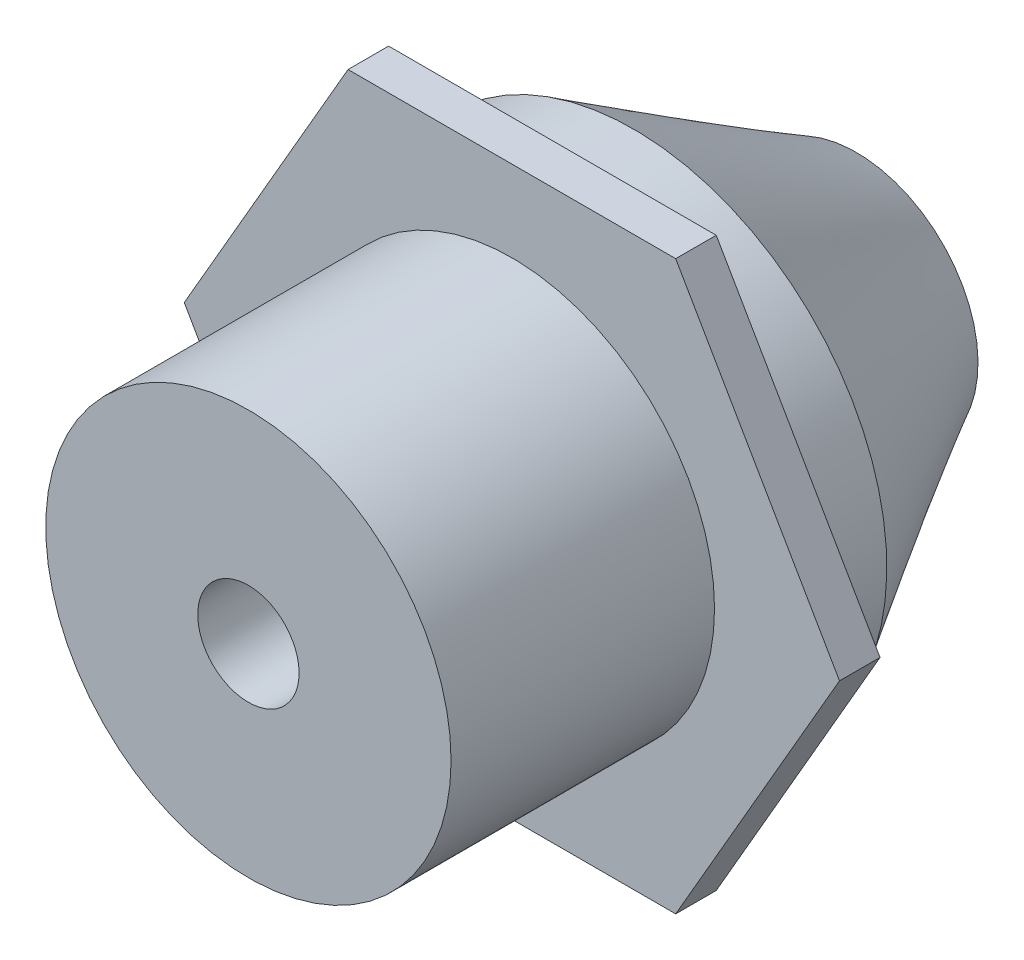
ISO-10303-21;
HEADER;
FILE_DESCRIPTION(('STEP AP214'),'2;1');
FILE_NAME('part.step','',(''),(''),'','','');
FILE_SCHEMA(('AUTOMOTIVE_DESIGN { 1 0 10303 214 1 1 1 1 }'));
ENDSEC;
DATA;
#1=APPLICATION_CONTEXT('core data for automotive mechanical design processes');
#2=APPLICATION_PROTOCOL_DEFINITION('international standard','automotive_design',2000,#1);
#3=PRODUCT_CONTEXT('',#1,'mechanical');
#4=PRODUCT('Part','Part','',(#3));
#5=PRODUCT_RELATED_PRODUCT_CATEGORY('part','',(#4));
#6=PRODUCT_DEFINITION_FORMATION('','',#4);
#7=PRODUCT_DEFINITION_CONTEXT('part definition',#1,'design');
#8=PRODUCT_DEFINITION('design','',#6,#7);
#9=PRODUCT_DEFINITION_SHAPE('','',#8);
#10=(LENGTH_UNIT() NAMED_UNIT(*) SI_UNIT(.MILLI.,.METRE.));
#11=(NAMED_UNIT(*) PLANE_ANGLE_UNIT() SI_UNIT($,.RADIAN.));
#12=(NAMED_UNIT(*) SI_UNIT($,.STERADIAN.) SOLID_ANGLE_UNIT());
#13=UNCERTAINTY_MEASURE_WITH_UNIT(LENGTH_MEASURE(1.E-05),#10,'distance_accuracy_value','');
#14=(GEOMETRIC_REPRESENTATION_CONTEXT(3) GLOBAL_UNCERTAINTY_ASSIGNED_CONTEXT((#13)) GLOBAL_UNIT_ASSIGNED_CONTEXT((#10,
#11,#12)) REPRESENTATION_CONTEXT('',''));
#15=CARTESIAN_POINT('',(0.,0.,0.));
#16=DIRECTION('',(0.,0.,1.));
#17=DIRECTION('',(1.,0.,0.));
#18=AXIS2_PLACEMENT_3D('',#15,#16,#17);
#19=CARTESIAN_POINT('',(0.,0.,-130.));
#20=DIRECTION('',(0.,0.,1.));
#21=DIRECTION('',(1.,0.,0.));
#22=AXIS2_PLACEMENT_3D('',#19,#20,#21);
#23=CYLINDRICAL_SURFACE('',#22,100.);
#24=CARTESIAN_POINT('',(0.,0.,-130.));
#25=DIRECTION('',(0.,0.,1.));
#26=DIRECTION('',(1.,0.,0.));
#27=AXIS2_PLACEMENT_3D('',#24,#25,#26);
#28=CIRCLE('',#27,100.);
#29=CARTESIAN_POINT('',(100.,0.,-130.));
#30=VERTEX_POINT('',#29);
#31=EDGE_CURVE('E150',#30,#30,#28,.T.);
#32=ORIENTED_EDGE('',*,*,#31,.T.);
#33=EDGE_LOOP('',(#32));
#34=FACE_BOUND('',#33,.T.);
#35=CARTESIAN_POINT('',(0.,0.,0.));
#36=DIRECTION('',(0.,0.,1.));
#37=DIRECTION('',(1.,0.,0.));
#38=AXIS2_PLACEMENT_3D('',#35,#36,#37);
#39=CIRCLE('',#38,100.);
#40=CARTESIAN_POINT('',(100.,0.,0.));
#41=VERTEX_POINT('',#40);
#42=EDGE_CURVE('E52',#41,#41,#39,.T.);
#43=ORIENTED_EDGE('',*,*,#42,.F.);
#44=EDGE_LOOP('',(#43));
#45=FACE_BOUND('',#44,.T.);
#46=ADVANCED_FACE('F43',(#34,#45),#23,.T.);
#47=CARTESIAN_POINT('',(0.,0.,0.));
#48=DIRECTION('',(0.,0.,1.));
#49=DIRECTION('',(1.,0.,0.));
#50=AXIS2_PLACEMENT_3D('',#47,#48,#49);
#51=PLANE('',#50);
#52=CARTESIAN_POINT('',(0.,0.,0.));
#53=DIRECTION('',(0.,0.,1.));
#54=DIRECTION('',(1.,0.,0.));
#55=AXIS2_PLACEMENT_3D('',#52,#53,#54);
#56=CIRCLE('',#55,25.);
#57=CARTESIAN_POINT('',(25.,0.,0.));
#58=VERTEX_POINT('',#57);
#59=EDGE_CURVE('E165',#58,#58,#56,.T.);
#60=ORIENTED_EDGE('',*,*,#59,.F.);
#61=EDGE_LOOP('',(#60));
#62=FACE_BOUND('',#61,.T.);
#63=ORIENTED_EDGE('',*,*,#42,.T.);
#64=EDGE_LOOP('',(#63));
#65=FACE_BOUND('',#64,.T.);
#66=ADVANCED_FACE('F200',(#62,#65),#51,.T.);
#67=CARTESIAN_POINT('',(-161.658075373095,0.,-150.));
#68=DIRECTION('',(0.866025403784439,-0.5,0.));
#69=DIRECTION('',(0.5,0.866025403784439,0.));
#70=AXIS2_PLACEMENT_3D('',#67,#68,#69);
#71=PLANE('',#70);
#72=DIRECTION('',(0.5,0.866025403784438,0.));
#73=VECTOR('',#72,1.);
#74=CARTESIAN_POINT('',(-161.658075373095,0.,-130.));
#75=LINE('',#74,#73);
#76=CARTESIAN_POINT('',(-161.658075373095,0.,-130.));
#77=VERTEX_POINT('',#76);
#78=CARTESIAN_POINT('',(-80.8290376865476,140.,-130.));
#79=VERTEX_POINT('',#78);
#80=EDGE_CURVE('E130',#77,#79,#75,.T.);
#81=ORIENTED_EDGE('',*,*,#80,.T.);
#82=DIRECTION('',(0.,0.,1.));
#83=VECTOR('',#82,1.);
#84=CARTESIAN_POINT('',(-80.8290376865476,140.,-150.));
#85=LINE('',#84,#83);
#86=CARTESIAN_POINT('',(-80.8290376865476,140.,-150.));
#87=VERTEX_POINT('',#86);
#88=EDGE_CURVE('E148',#87,#79,#85,.T.);
#89=ORIENTED_EDGE('',*,*,#88,.F.);
#90=DIRECTION('',(0.5,0.866025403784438,0.));
#91=VECTOR('',#90,1.);
#92=CARTESIAN_POINT('',(-161.658075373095,0.,-150.));
#93=LINE('',#92,#91);
#94=CARTESIAN_POINT('',(-161.658075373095,0.,-150.));
#95=VERTEX_POINT('',#94);
#96=EDGE_CURVE('E141',#95,#87,#93,.T.);
#97=ORIENTED_EDGE('',*,*,#96,.F.);
#98=DIRECTION('',(0.,0.,1.));
#99=VECTOR('',#98,1.);
#100=CARTESIAN_POINT('',(-161.658075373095,0.,-150.));
#101=LINE('',#100,#99);
#102=EDGE_CURVE('E126',#95,#77,#101,.T.);
#103=ORIENTED_EDGE('',*,*,#102,.T.);
#104=EDGE_LOOP('',(#81,#89,#97,#103));
#105=FACE_BOUND('',#104,.T.);
#106=ADVANCED_FACE('F186',(#105),#71,.F.);
#107=CARTESIAN_POINT('',(-80.8290376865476,140.,-150.));
#108=DIRECTION('',(0.,-1.,0.));
#109=DIRECTION('',(1.,0.,0.));
#110=AXIS2_PLACEMENT_3D('',#107,#108,#109);
#111=PLANE('',#110);
#112=DIRECTION('',(1.,0.,0.));
#113=VECTOR('',#112,1.);
#114=CARTESIAN_POINT('',(-80.8290376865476,140.,-130.));
#115=LINE('',#114,#113);
#116=CARTESIAN_POINT('',(80.8290376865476,140.,-130.));
#117=VERTEX_POINT('',#116);
#118=EDGE_CURVE('E133',#79,#117,#115,.T.);
#119=ORIENTED_EDGE('',*,*,#118,.T.);
#120=DIRECTION('',(0.,0.,1.));
#121=VECTOR('',#120,1.);
#122=CARTESIAN_POINT('',(80.8290376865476,140.,-150.));
#123=LINE('',#122,#121);
#124=CARTESIAN_POINT('',(80.8290376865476,140.,-150.));
#125=VERTEX_POINT('',#124);
#126=EDGE_CURVE('E145',#125,#117,#123,.T.);
#127=ORIENTED_EDGE('',*,*,#126,.F.);
#128=DIRECTION('',(1.,0.,0.));
#129=VECTOR('',#128,1.);
#130=CARTESIAN_POINT('',(-80.8290376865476,140.,-150.));
#131=LINE('',#130,#129);
#132=EDGE_CURVE('E99',#87,#125,#131,.T.);
#133=ORIENTED_EDGE('',*,*,#132,.F.);
#134=ORIENTED_EDGE('',*,*,#88,.T.);
#135=EDGE_LOOP('',(#119,#127,#133,#134));
#136=FACE_BOUND('',#135,.T.);
#137=ADVANCED_FACE('F178',(#136),#111,.F.);
#138=CARTESIAN_POINT('',(80.8290376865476,140.,-150.));
#139=DIRECTION('',(-0.866025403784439,-0.5,0.));
#140=DIRECTION('',(0.5,-0.866025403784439,0.));
#141=AXIS2_PLACEMENT_3D('',#138,#139,#140);
#142=PLANE('',#141);
#143=DIRECTION('',(0.499999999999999,-0.866025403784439,0.));
#144=VECTOR('',#143,1.);
#145=CARTESIAN_POINT('',(80.8290376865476,140.,-130.));
#146=LINE('',#145,#144);
#147=CARTESIAN_POINT('',(161.658075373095,-1.11022302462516E-13,-130.));
#148=VERTEX_POINT('',#147);
#149=EDGE_CURVE('E136',#117,#148,#146,.T.);
#150=ORIENTED_EDGE('',*,*,#149,.T.);
#151=DIRECTION('',(0.,0.,1.));
#152=VECTOR('',#151,1.);
#153=CARTESIAN_POINT('',(161.658075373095,-1.11022302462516E-13,-150.));
#154=LINE('',#153,#152);
#155=CARTESIAN_POINT('',(161.658075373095,-1.11022302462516E-13,-150.));
#156=VERTEX_POINT('',#155);
#157=EDGE_CURVE('E121',#156,#148,#154,.T.);
#158=ORIENTED_EDGE('',*,*,#157,.F.);
#159=DIRECTION('',(0.499999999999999,-0.866025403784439,0.));
#160=VECTOR('',#159,1.);
#161=CARTESIAN_POINT('',(80.8290376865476,140.,-150.));
#162=LINE('',#161,#160);
#163=EDGE_CURVE('E112',#125,#156,#162,.T.);
#164=ORIENTED_EDGE('',*,*,#163,.F.);
#165=ORIENTED_EDGE('',*,*,#126,.T.);
#166=EDGE_LOOP('',(#150,#158,#164,#165));
#167=FACE_BOUND('',#166,.T.);
#168=ADVANCED_FACE('F181',(#167),#142,.F.);
#169=CARTESIAN_POINT('',(161.658075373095,-1.11022302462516E-13,-150.));
#170=DIRECTION('',(-0.866025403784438,0.5,0.));
#171=DIRECTION('',(-0.5,-0.866025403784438,0.));
#172=AXIS2_PLACEMENT_3D('',#169,#170,#171);
#173=PLANE('',#172);
#174=DIRECTION('',(-0.5,-0.866025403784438,0.));
#175=VECTOR('',#174,1.);
#176=CARTESIAN_POINT('',(161.658075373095,-1.11022302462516E-13,-130.));
#177=LINE('',#176,#175);
#178=CARTESIAN_POINT('',(80.8290376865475,-140.,-130.));
#179=VERTEX_POINT('',#178);
#180=EDGE_CURVE('E120',#148,#179,#177,.T.);
#181=ORIENTED_EDGE('',*,*,#180,.T.);
#182=DIRECTION('',(0.,0.,1.));
#183=VECTOR('',#182,1.);
#184=CARTESIAN_POINT('',(80.8290376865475,-140.,-150.));
#185=LINE('',#184,#183);
#186=CARTESIAN_POINT('',(80.8290376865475,-140.,-150.));
#187=VERTEX_POINT('',#186);
#188=EDGE_CURVE('E117',#187,#179,#185,.T.);
#189=ORIENTED_EDGE('',*,*,#188,.F.);
#190=DIRECTION('',(-0.5,-0.866025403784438,0.));
#191=VECTOR('',#190,1.);
#192=CARTESIAN_POINT('',(161.658075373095,-1.11022302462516E-13,-150.));
#193=LINE('',#192,#191);
#194=EDGE_CURVE('E106',#156,#187,#193,.T.);
#195=ORIENTED_EDGE('',*,*,#194,.F.);
#196=ORIENTED_EDGE('',*,*,#157,.T.);
#197=EDGE_LOOP('',(#181,#189,#195,#196));
#198=FACE_BOUND('',#197,.T.);
#199=ADVANCED_FACE('F118',(#198),#173,.F.);
#200=CARTESIAN_POINT('',(80.8290376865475,-140.,-150.));
#201=DIRECTION('',(0.,1.,0.));
#202=DIRECTION('',(-1.,0.,0.));
#203=AXIS2_PLACEMENT_3D('',#200,#201,#202);
#204=PLANE('',#203);
#205=DIRECTION('',(-1.,0.,0.));
#206=VECTOR('',#205,1.);
#207=CARTESIAN_POINT('',(80.8290376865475,-140.,-130.));
#208=LINE('',#207,#206);
#209=CARTESIAN_POINT('',(-80.8290376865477,-140.,-130.));
#210=VERTEX_POINT('',#209);
#211=EDGE_CURVE('E84',#179,#210,#208,.T.);
#212=ORIENTED_EDGE('',*,*,#211,.T.);
#213=DIRECTION('',(0.,0.,1.));
#214=VECTOR('',#213,1.);
#215=CARTESIAN_POINT('',(-80.8290376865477,-140.,-150.));
#216=LINE('',#215,#214);
#217=CARTESIAN_POINT('',(-80.8290376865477,-140.,-150.));
#218=VERTEX_POINT('',#217);
#219=EDGE_CURVE('E122',#218,#210,#216,.T.);
#220=ORIENTED_EDGE('',*,*,#219,.F.);
#221=DIRECTION('',(-1.,0.,0.));
#222=VECTOR('',#221,1.);
#223=CARTESIAN_POINT('',(80.8290376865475,-140.,-150.));
#224=LINE('',#223,#222);
#225=EDGE_CURVE('E110',#187,#218,#224,.T.);
#226=ORIENTED_EDGE('',*,*,#225,.F.);
#227=ORIENTED_EDGE('',*,*,#188,.T.);
#228=EDGE_LOOP('',(#212,#220,#226,#227));
#229=FACE_BOUND('',#228,.T.);
#230=ADVANCED_FACE('F124',(#229),#204,.F.);
#231=CARTESIAN_POINT('',(-80.8290376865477,-140.,-150.));
#232=DIRECTION('',(0.866025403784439,0.499999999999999,0.));
#233=DIRECTION('',(-0.499999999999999,0.866025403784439,0.));
#234=AXIS2_PLACEMENT_3D('',#231,#232,#233);
#235=PLANE('',#234);
#236=DIRECTION('',(-0.499999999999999,0.866025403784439,0.));
#237=VECTOR('',#236,1.);
#238=CARTESIAN_POINT('',(-80.8290376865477,-140.,-130.));
#239=LINE('',#238,#237);
#240=EDGE_CURVE('E90',#210,#77,#239,.T.);
#241=ORIENTED_EDGE('',*,*,#240,.T.);
#242=ORIENTED_EDGE('',*,*,#102,.F.);
#243=DIRECTION('',(-0.499999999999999,0.866025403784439,0.));
#244=VECTOR('',#243,1.);
#245=CARTESIAN_POINT('',(-80.8290376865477,-140.,-150.));
#246=LINE('',#245,#244);
#247=EDGE_CURVE('E61',#218,#95,#246,.T.);
#248=ORIENTED_EDGE('',*,*,#247,.F.);
#249=ORIENTED_EDGE('',*,*,#219,.T.);
#250=EDGE_LOOP('',(#241,#242,#248,#249));
#251=FACE_BOUND('',#250,.T.);
#252=ADVANCED_FACE('F187',(#251),#235,.F.);
#253=CARTESIAN_POINT('',(0.,0.,-150.));
#254=DIRECTION('',(0.,0.,-1.));
#255=DIRECTION('',(-1.,0.,0.));
#256=AXIS2_PLACEMENT_3D('',#253,#254,#255);
#257=PLANE('',#256);
#258=CARTESIAN_POINT('',(0.,0.,-150.));
#259=DIRECTION('',(0.,0.,-1.));
#260=DIRECTION('',(-1.,0.,0.));
#261=AXIS2_PLACEMENT_3D('',#258,#259,#260);
#262=CIRCLE('',#261,125.);
#263=CARTESIAN_POINT('',(-125.,0.,-150.));
#264=VERTEX_POINT('',#263);
#265=EDGE_CURVE('E12',#264,#264,#262,.T.);
#266=ORIENTED_EDGE('',*,*,#265,.F.);
#267=EDGE_LOOP('',(#266));
#268=FACE_BOUND('',#267,.T.);
#269=ORIENTED_EDGE('',*,*,#96,.T.);
#270=ORIENTED_EDGE('',*,*,#132,.T.);
#271=ORIENTED_EDGE('',*,*,#163,.T.);
#272=ORIENTED_EDGE('',*,*,#194,.T.);
#273=ORIENTED_EDGE('',*,*,#225,.T.);
#274=ORIENTED_EDGE('',*,*,#247,.T.);
#275=EDGE_LOOP('',(#269,#270,#271,#272,#273,#274));
#276=FACE_BOUND('',#275,.T.);
#277=ADVANCED_FACE('F108',(#268,#276),#257,.T.);
#278=CARTESIAN_POINT('',(0.,0.,-130.));
#279=DIRECTION('',(0.,0.,-1.));
#280=DIRECTION('',(-1.,0.,0.));
#281=AXIS2_PLACEMENT_3D('',#278,#279,#280);
#282=PLANE('',#281);
#283=ORIENTED_EDGE('',*,*,#31,.F.);
#284=EDGE_LOOP('',(#283));
#285=FACE_BOUND('',#284,.T.);
#286=ORIENTED_EDGE('',*,*,#80,.F.);
#287=ORIENTED_EDGE('',*,*,#240,.F.);
#288=ORIENTED_EDGE('',*,*,#211,.F.);
#289=ORIENTED_EDGE('',*,*,#180,.F.);
#290=ORIENTED_EDGE('',*,*,#149,.F.);
#291=ORIENTED_EDGE('',*,*,#118,.F.);
#292=EDGE_LOOP('',(#286,#287,#288,#289,#290,#291));
#293=FACE_BOUND('',#292,.T.);
#294=ADVANCED_FACE('F184',(#285,#293),#282,.F.);
#295=CARTESIAN_POINT('',(0.,0.,-190.));
#296=DIRECTION('',(0.,0.,1.));
#297=DIRECTION('',(1.,0.,0.));
#298=AXIS2_PLACEMENT_3D('',#295,#296,#297);
#299=CYLINDRICAL_SURFACE('',#298,125.);
#300=CARTESIAN_POINT('',(0.,0.,-190.));
#301=DIRECTION('',(0.,0.,1.));
#302=DIRECTION('',(1.,0.,0.));
#303=AXIS2_PLACEMENT_3D('',#300,#301,#302);
#304=CIRCLE('',#303,125.);
#305=CARTESIAN_POINT('',(124.717613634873,8.39743110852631,-190.));
#306=VERTEX_POINT('',#305);
#307=EDGE_CURVE('E134',#306,#306,#304,.F.);
#308=ORIENTED_EDGE('',*,*,#307,.F.);
#309=EDGE_LOOP('',(#308));
#310=FACE_BOUND('',#309,.T.);
#311=ORIENTED_EDGE('',*,*,#265,.T.);
#312=EDGE_LOOP('',(#311));
#313=FACE_BOUND('',#312,.T.);
#314=ADVANCED_FACE('F212',(#310,#313),#299,.T.);
#315=CARTESIAN_POINT('',(0.,0.,-300.));
#316=DIRECTION('',(0.,0.,1.));
#317=DIRECTION('',(1.,0.,0.));
#318=AXIS2_PLACEMENT_3D('',#315,#316,#317);
#319=PLANE('',#318);
#320=CARTESIAN_POINT('',(0.,0.,-300.));
#321=DIRECTION('',(0.,0.,1.));
#322=DIRECTION('',(1.,0.,0.));
#323=AXIS2_PLACEMENT_3D('',#320,#321,#322);
#324=CIRCLE('',#323,60.);
#325=CARTESIAN_POINT('',(58.4461440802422,-13.5664380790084,-300.));
#326=VERTEX_POINT('',#325);
#327=EDGE_CURVE('E155',#326,#326,#324,.T.);
#328=ORIENTED_EDGE('',*,*,#327,.F.);
#329=EDGE_LOOP('',(#328));
#330=FACE_BOUND('',#329,.T.);
#331=ADVANCED_FACE('F216',(#330),#319,.F.);
#332=CARTESIAN_POINT('',(124.717613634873,8.39743110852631,-190.));
#333=CARTESIAN_POINT('',(58.4461440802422,-13.5664380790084,-300.));
#334=CARTESIAN_POINT('',(141.512475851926,-241.03779616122,-190.));
#335=CARTESIAN_POINT('',(31.3132679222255,-130.458726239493,-300.));
#336=CARTESIAN_POINT('',(-107.922751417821,-257.832658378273,-190.));
#337=CARTESIAN_POINT('',(-85.5790202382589,-103.325850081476,-300.));
#338=CARTESIAN_POINT('',(-124.717613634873,-8.39743110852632,-190.));
#339=CARTESIAN_POINT('',(-58.4461440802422,13.5664380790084,-300.));
#340=CARTESIAN_POINT('',(-141.512475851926,241.03779616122,-190.));
#341=CARTESIAN_POINT('',(-31.3132679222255,130.458726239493,-300.));
#342=CARTESIAN_POINT('',(107.922751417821,257.832658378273,-190.));
#343=CARTESIAN_POINT('',(85.579020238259,103.325850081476,-300.));
#344=CARTESIAN_POINT('',(124.717613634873,8.39743110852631,-190.));
#345=CARTESIAN_POINT('',(58.4461440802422,-13.5664380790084,-300.));
#346=(BOUNDED_SURFACE() B_SPLINE_SURFACE(3,1,((#332,#333),(#334,#335),(#336,#337),(#338,#339),
(#340,#341),(#342,#343),(#344,#345)),.UNSPECIFIED.,.T.,.F.,.F.) B_SPLINE_SURFACE_WITH_KNOTS((4,
3,4),(2,2),(0.,0.5,1.),(0.,1.),
.UNSPECIFIED.) GEOMETRIC_REPRESENTATION_ITEM() RATIONAL_B_SPLINE_SURFACE(((1.,1.),
(0.333333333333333,0.333333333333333),(0.333333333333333,0.333333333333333),(1.,1.),
(0.333333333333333,0.333333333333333),(0.333333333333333,0.333333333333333),(1.,1.))) REPRESENTATION_ITEM('') SURFACE());
#347=CARTESIAN_POINT('',(124.717613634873,8.39743110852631,-190.));
#348=CARTESIAN_POINT('',(124.027285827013,8.16864080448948,-191.145833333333));
#349=CARTESIAN_POINT('',(123.336958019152,7.93985050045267,-192.291666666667));
#350=CARTESIAN_POINT('',(121.95630240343,7.48226989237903,-194.583333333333));
#351=CARTESIAN_POINT('',(121.26597459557,7.25347958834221,-195.729166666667));
#352=CARTESIAN_POINT('',(119.885318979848,6.79589898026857,-198.020833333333));
#353=CARTESIAN_POINT('',(119.194991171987,6.56710867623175,-199.166666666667));
#354=CARTESIAN_POINT('',(117.814335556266,6.10952806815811,-201.458333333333));
#355=CARTESIAN_POINT('',(117.124007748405,5.88073776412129,-202.604166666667));
#356=CARTESIAN_POINT('',(115.743352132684,5.42315715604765,-204.895833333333));
#357=CARTESIAN_POINT('',(115.053024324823,5.19436685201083,-206.041666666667));
#358=CARTESIAN_POINT('',(113.672368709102,4.73678624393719,-208.333333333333));
#359=CARTESIAN_POINT('',(112.982040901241,4.50799593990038,-209.479166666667));
#360=CARTESIAN_POINT('',(111.601385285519,4.05041533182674,-211.770833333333));
#361=CARTESIAN_POINT('',(110.911057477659,3.82162502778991,-212.916666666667));
#362=CARTESIAN_POINT('',(109.530401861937,3.36404441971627,-215.208333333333));
#363=CARTESIAN_POINT('',(108.840074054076,3.13525411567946,-216.354166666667));
#364=CARTESIAN_POINT('',(107.459418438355,2.67767350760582,-218.645833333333));
#365=CARTESIAN_POINT('',(106.769090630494,2.448883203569,-219.791666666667));
#366=CARTESIAN_POINT('',(105.388435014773,1.99130259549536,-222.083333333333));
#367=CARTESIAN_POINT('',(104.698107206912,1.76251229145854,-223.229166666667));
#368=CARTESIAN_POINT('',(103.31745159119,1.3049316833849,-225.520833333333));
#369=CARTESIAN_POINT('',(102.62712378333,1.07614137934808,-226.666666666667));
#370=CARTESIAN_POINT('',(101.246468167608,0.61856077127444,-228.958333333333));
#371=CARTESIAN_POINT('',(100.556140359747,0.38977046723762,-230.104166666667));
#372=CARTESIAN_POINT('',(99.175484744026,-0.0678101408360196,-232.395833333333));
#373=CARTESIAN_POINT('',(98.4851569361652,-0.296600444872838,-233.541666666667));
#374=CARTESIAN_POINT('',(97.1045013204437,-0.754181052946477,-235.833333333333));
#375=CARTESIAN_POINT('',(96.414173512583,-0.982971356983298,-236.979166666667));
#376=CARTESIAN_POINT('',(95.0335178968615,-1.44055196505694,-239.270833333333));
#377=CARTESIAN_POINT('',(94.3431900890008,-1.66934226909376,-240.416666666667));
#378=CARTESIAN_POINT('',(92.9625344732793,-2.1269228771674,-242.708333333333));
#379=CARTESIAN_POINT('',(92.2722066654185,-2.35571318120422,-243.854166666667));
#380=CARTESIAN_POINT('',(90.8915510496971,-2.81329378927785,-246.145833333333));
#381=CARTESIAN_POINT('',(90.2012232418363,-3.04208409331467,-247.291666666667));
#382=CARTESIAN_POINT('',(88.8205676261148,-3.49966470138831,-249.583333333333));
#383=CARTESIAN_POINT('',(88.1302398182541,-3.72845500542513,-250.729166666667));
#384=CARTESIAN_POINT('',(86.7495842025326,-4.18603561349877,-253.020833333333));
#385=CARTESIAN_POINT('',(86.0592563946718,-4.41482591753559,-254.166666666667));
#386=CARTESIAN_POINT('',(84.6786007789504,-4.87240652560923,-256.458333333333));
#387=CARTESIAN_POINT('',(83.9882729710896,-5.10119682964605,-257.604166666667));
#388=CARTESIAN_POINT('',(82.6076173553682,-5.55877743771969,-259.895833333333));
#389=CARTESIAN_POINT('',(81.9172895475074,-5.78756774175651,-261.041666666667));
#390=CARTESIAN_POINT('',(80.5366339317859,-6.24514834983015,-263.333333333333));
#391=CARTESIAN_POINT('',(79.8463061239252,-6.47393865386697,-264.479166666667));
#392=CARTESIAN_POINT('',(78.4656505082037,-6.93151926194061,-266.770833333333));
#393=CARTESIAN_POINT('',(77.775322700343,-7.16030956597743,-267.916666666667));
#394=CARTESIAN_POINT('',(76.3946670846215,-7.61789017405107,-270.208333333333));
#395=CARTESIAN_POINT('',(75.7043392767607,-7.84668047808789,-271.354166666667));
#396=CARTESIAN_POINT('',(74.3236836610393,-8.30426108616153,-273.645833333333));
#397=CARTESIAN_POINT('',(73.6333558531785,-8.53305139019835,-274.791666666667));
#398=CARTESIAN_POINT('',(72.252700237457,-8.99063199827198,-277.083333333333));
#399=CARTESIAN_POINT('',(71.5623724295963,-9.2194223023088,-278.229166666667));
#400=CARTESIAN_POINT('',(70.1817168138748,-9.67700291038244,-280.520833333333));
#401=CARTESIAN_POINT('',(69.4913890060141,-9.90579321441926,-281.666666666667));
#402=CARTESIAN_POINT('',(68.1107333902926,-10.3633738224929,-283.958333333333));
#403=CARTESIAN_POINT('',(67.4204055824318,-10.5921641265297,-285.104166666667));
#404=CARTESIAN_POINT('',(66.0397499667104,-11.0497447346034,-287.395833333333));
#405=CARTESIAN_POINT('',(65.3494221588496,-11.2785350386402,-288.541666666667));
#406=CARTESIAN_POINT('',(63.9687665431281,-11.7361156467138,-290.833333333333));
#407=CARTESIAN_POINT('',(63.2784387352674,-11.9649059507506,-291.979166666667));
#408=CARTESIAN_POINT('',(61.8977831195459,-12.4224865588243,-294.270833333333));
#409=CARTESIAN_POINT('',(61.2074553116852,-12.6512768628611,-295.416666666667));
#410=CARTESIAN_POINT('',(59.8267996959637,-13.1088574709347,-297.708333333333));
#411=CARTESIAN_POINT('',(59.1364718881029,-13.3376477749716,-298.854166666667));
#412=CARTESIAN_POINT('',(58.4461440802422,-13.5664380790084,-300.));
#413=B_SPLINE_CURVE_WITH_KNOTS('',3,(#347,#348,#349,#350,#351,#352,#353,#354,#355,#356,#357,
#358,#359,#360,#361,#362,#363,#364,#365,#366,#367,#368,#369,#370,#371,#372,#373,#374,#375,#376,
#377,#378,#379,#380,#381,#382,#383,#384,#385,#386,#387,#388,#389,#390,#391,#392,#393,#394,#395,
#396,#397,#398,#399,#400,#401,#402,#403,#404,#405,#406,#407,#408,#409,#410,#411,#412),
.UNSPECIFIED.,.F.,.F.,(4,2,2,2,2,2,2,2,2,2,2,2,2,2,2,2,2,2,2,2,2,2,2,2,2,2,2,2,2,2,2,2,4),(0.,
4.07142280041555,8.14284560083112,12.2142684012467,16.2856912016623,20.3571140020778,
24.4285368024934,28.4999596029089,32.5713824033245,36.6428052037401,40.7142280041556,
44.7856508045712,48.8570736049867,52.9284964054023,56.9999192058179,61.0713420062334,
65.142764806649,69.2141876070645,73.2856104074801,77.3570332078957,81.4284560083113,
85.4998788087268,89.5713016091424,93.6427244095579,97.7141472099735,101.785570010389,
105.856992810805,109.92841561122,113.999838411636,118.071261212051,122.142684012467,
126.214106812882,130.285529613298),.UNSPECIFIED.);
#414=EDGE_CURVE('BSEAM220',#306,#326,#413,.T.);
#415=ORIENTED_EDGE('',*,*,#307,.T.);
#416=ORIENTED_EDGE('',*,*,#327,.T.);
#417=ORIENTED_EDGE('',*,*,#414,.T.);
#418=ORIENTED_EDGE('',*,*,#414,.F.);
#419=EDGE_LOOP('',(#415,#417,#416,#418));
#420=FACE_BOUND('',#419,.T.);
#421=ADVANCED_FACE('F220',(#420),#346,.T.);
#422=CARTESIAN_POINT('',(0.,0.,-50.));
#423=DIRECTION('',(0.,0.,1.));
#424=DIRECTION('',(1.,0.,0.));
#425=AXIS2_PLACEMENT_3D('',#422,#423,#424);
#426=CYLINDRICAL_SURFACE('',#425,25.);
#427=CARTESIAN_POINT('',(0.,0.,-50.));
#428=DIRECTION('',(0.,0.,1.));
#429=DIRECTION('',(1.,0.,0.));
#430=AXIS2_PLACEMENT_3D('',#427,#428,#429);
#431=CIRCLE('',#430,25.);
#432=CARTESIAN_POINT('',(25.,0.,-50.));
#433=VERTEX_POINT('',#432);
#434=EDGE_CURVE('E159',#433,#433,#431,.T.);
#435=ORIENTED_EDGE('',*,*,#434,.F.);
#436=EDGE_LOOP('',(#435));
#437=FACE_BOUND('',#436,.T.);
#438=ORIENTED_EDGE('',*,*,#59,.T.);
#439=EDGE_LOOP('',(#438));
#440=FACE_BOUND('',#439,.T.);
#441=ADVANCED_FACE('F225',(#437,#440),#426,.F.);
#442=CARTESIAN_POINT('',(0.,0.,-50.));
#443=DIRECTION('',(0.,0.,1.));
#444=DIRECTION('',(1.,0.,0.));
#445=AXIS2_PLACEMENT_3D('',#442,#443,#444);
#446=PLANE('',#445);
#447=ORIENTED_EDGE('',*,*,#434,.T.);
#448=EDGE_LOOP('',(#447));
#449=FACE_BOUND('',#448,.T.);
#450=ADVANCED_FACE('F266',(#449),#446,.T.);
#451=CLOSED_SHELL('',(#46,#66,#106,#137,#168,#199,#230,#252,#277,#294,#314,#331,#421,#441,#450));
#452=MANIFOLD_SOLID_BREP('B2',#451);
#453=ADVANCED_BREP_SHAPE_REPRESENTATION('',(#18,#452),#14);
#454=SHAPE_DEFINITION_REPRESENTATION(#9,#453);
ENDSEC;
END-ISO-10303-21;
